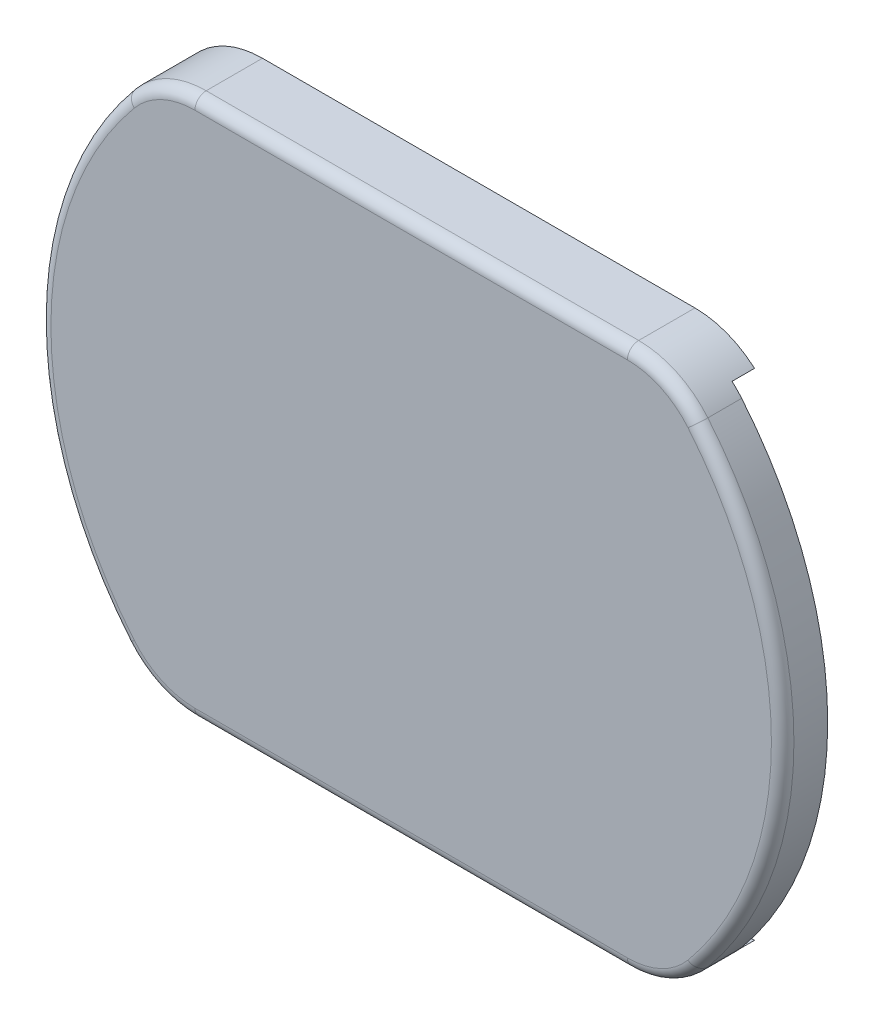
from build123d import *

# Parameters (mm, degrees)
EXTRUDE1_DEPTH     = 3
FILLET2_R          = 0.5
CUT_EXTRUDE1_DEPTH = 1
CUT_EXTRUDE2_DEPTH = 1
SKETCH5_W          = 0.25
SKETCH5_H          = 0.5
CUT_EXTRUDE5_DEPTH = 20


with BuildPart() as part:
    # Sketch1 → Extrude1 (new body)
    with BuildSketch(Plane.XY):
        with BuildLine():
            Line((-9.604686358, -12), (9.604686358, -12))
            ThreePointArc((9.604686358, -12), (11.301742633, -11.622154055), (12.678185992, -10.559999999))
            ThreePointArc((12.678185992, -10.559999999), (16.5, 1e-09), (12.678185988, 10.560000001))
            ThreePointArc((12.678185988, 10.560000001), (11.301742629, 11.622154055), (9.604686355, 12))
            Line((9.604686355, 12), (-9.604686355, 12))
            ThreePointArc((-9.604686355, 12), (-11.301742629, 11.622154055), (-12.678185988, 10.560000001))
            ThreePointArc((-12.678185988, 10.560000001), (-16.5, 1e-09), (-12.678185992, -10.559999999))
            ThreePointArc((-12.678185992, -10.559999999), (-11.301742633, -11.622154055), (-9.604686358, -12))
        make_face()
    extrude(amount=EXTRUDE1_DEPTH)

    # Fillet2
    fillet2_edges = [part.edges().sort_by_distance(p)[0] for p in [
        (11.301742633, -11.622154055, 3),
        (16.5, 1e-09, 3),
        (11.301742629, 11.622154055, 3),
        (0, 12, 3),
        (-11.301742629, 11.622154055, 3),
        (-16.5, 1e-09, 3),
        (-11.301742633, -11.622154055, 3),
        (0, -12, 3),
    ]]
    fillet(fillet2_edges, radius=FILLET2_R)

    # Sketch2 → Cut-Extrude1 (cut)
    with BuildSketch(Plane(origin=(0, 0, 0), x_dir=(-1, 0, 0), z_dir=(0, 0, -1))):
        with BuildLine():
            Line((9.604686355, 10.5), (-12.72792206, 10.5))
            ThreePointArc((-12.72792206, 10.5), (-16.5, 1e-09), (-12.727922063, -10.5))
            Line((-12.727922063, -10.5), (9.604686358, -10.5))
            ThreePointArc((9.604686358, -10.5), (10.66534653, -10.263846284), (11.525623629, -9.6))
            ThreePointArc((11.525623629, -9.6), (15, 1e-09), (11.525623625, 9.6))
            ThreePointArc((11.525623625, 9.6), (10.665346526, 10.263846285), (9.604686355, 10.5))
        make_face()
    extrude(amount=-CUT_EXTRUDE1_DEPTH, mode=Mode.SUBTRACT)

    # d1mm → Cut-Extrude2 (cut)
    with BuildSketch(Plane(origin=(0, 0, 0), x_dir=(-1, 0, 0), z_dir=(0, 0, -1))):
        with BuildLine():
            Line((-10.5, -11), (-10.5, 11))
            Line((-10.5, 11), (-12.298373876, 11))
            ThreePointArc((-12.298373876, 11), (-16.5, 0), (-12.298373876, -11))
            Line((-12.298373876, -11), (-10.5, -11))
        make_face()
    extrude(amount=-CUT_EXTRUDE2_DEPTH, mode=Mode.SUBTRACT)

    # Sketch5 → Cut-Extrude5 (cut)
    with BuildSketch(Plane(origin=(10.5, 0, 0), x_dir=(0, 0, -1), z_dir=(1, 0, 0))):
        with Locations((-0.875, 10.75)):
            Rectangle(SKETCH5_W, SKETCH5_H)
    cut_extrude5 = extrude(amount=-CUT_EXTRUDE5_DEPTH, mode=Mode.SUBTRACT)

    # Mirror3: Cut-Extrude5 across plane
    add(cut_extrude5.mirror(Plane.ZX), mode=Mode.SUBTRACT)


solid = part.part
